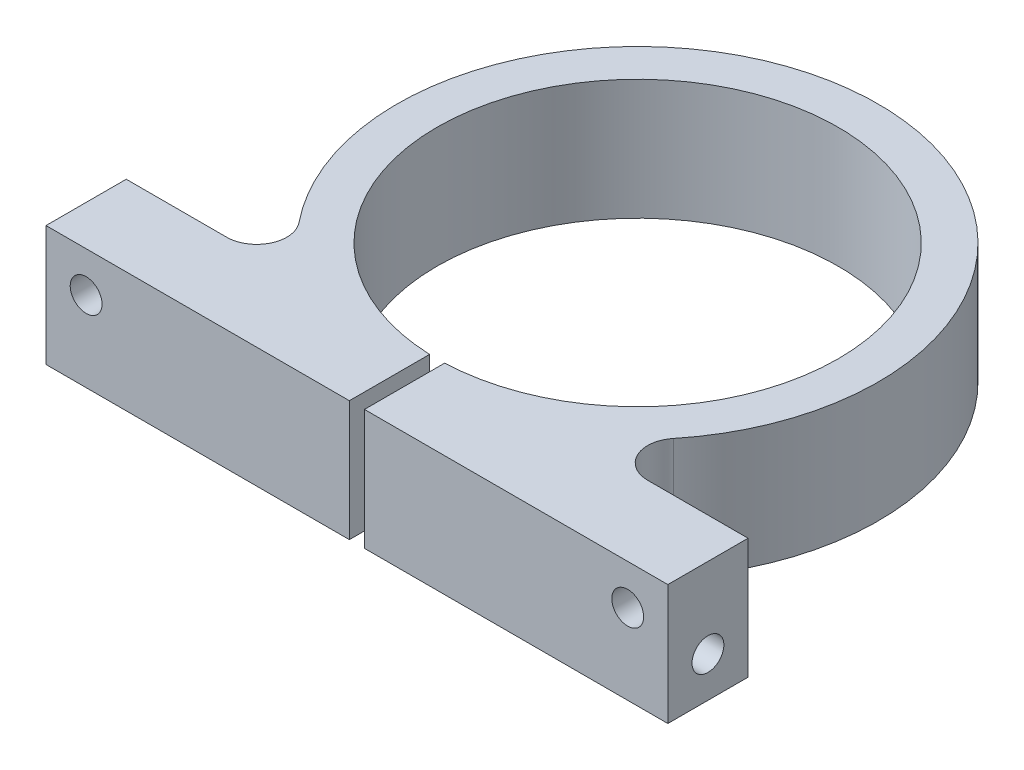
ISO-10303-21;
HEADER;
FILE_DESCRIPTION(('STEP AP214'),'2;1');
FILE_NAME('part.step','',(''),(''),'','','');
FILE_SCHEMA(('AUTOMOTIVE_DESIGN { 1 0 10303 214 1 1 1 1 }'));
ENDSEC;
DATA;
#1=APPLICATION_CONTEXT('core data for automotive mechanical design processes');
#2=APPLICATION_PROTOCOL_DEFINITION('international standard','automotive_design',2000,#1);
#3=PRODUCT_CONTEXT('',#1,'mechanical');
#4=PRODUCT('Part','Part','',(#3));
#5=PRODUCT_RELATED_PRODUCT_CATEGORY('part','',(#4));
#6=PRODUCT_DEFINITION_FORMATION('','',#4);
#7=PRODUCT_DEFINITION_CONTEXT('part definition',#1,'design');
#8=PRODUCT_DEFINITION('design','',#6,#7);
#9=PRODUCT_DEFINITION_SHAPE('','',#8);
#10=(LENGTH_UNIT() NAMED_UNIT(*) SI_UNIT(.MILLI.,.METRE.));
#11=(NAMED_UNIT(*) PLANE_ANGLE_UNIT() SI_UNIT($,.RADIAN.));
#12=(NAMED_UNIT(*) SI_UNIT($,.STERADIAN.) SOLID_ANGLE_UNIT());
#13=UNCERTAINTY_MEASURE_WITH_UNIT(LENGTH_MEASURE(1.E-05),#10,'distance_accuracy_value','');
#14=(GEOMETRIC_REPRESENTATION_CONTEXT(3) GLOBAL_UNCERTAINTY_ASSIGNED_CONTEXT((#13)) GLOBAL_UNIT_ASSIGNED_CONTEXT((#10,
#11,#12)) REPRESENTATION_CONTEXT('',''));
#15=CARTESIAN_POINT('',(0.,0.,0.));
#16=DIRECTION('',(0.,0.,1.));
#17=DIRECTION('',(1.,0.,0.));
#18=AXIS2_PLACEMENT_3D('',#15,#16,#17);
#19=CARTESIAN_POINT('',(-98.425,38.1,63.4550972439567));
#20=DIRECTION('',(1.,0.,0.));
#21=DIRECTION('',(0.,0.,-1.));
#22=AXIS2_PLACEMENT_3D('',#19,#20,#21);
#23=PLANE('',#22);
#24=CARTESIAN_POINT('',(-98.425,12.7,76.1550972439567));
#25=DIRECTION('',(-1.,0.,0.));
#26=DIRECTION('',(0.,0.,1.));
#27=AXIS2_PLACEMENT_3D('',#24,#25,#26);
#28=CIRCLE('',#27,5.04189999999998);
#29=CARTESIAN_POINT('',(-98.425,12.7,81.1969972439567));
#30=VERTEX_POINT('',#29);
#31=EDGE_CURVE('E274',#30,#30,#28,.T.);
#32=ORIENTED_EDGE('',*,*,#31,.F.);
#33=EDGE_LOOP('',(#32));
#34=FACE_BOUND('',#33,.T.);
#35=DIRECTION('',(0.,0.,1.));
#36=VECTOR('',#35,1.);
#37=CARTESIAN_POINT('',(-98.425,0.,63.4550972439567));
#38=LINE('',#37,#36);
#39=CARTESIAN_POINT('',(-98.425,0.,63.4550972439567));
#40=VERTEX_POINT('',#39);
#41=CARTESIAN_POINT('',(-98.425,0.,88.8550972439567));
#42=VERTEX_POINT('',#41);
#43=EDGE_CURVE('E124',#40,#42,#38,.T.);
#44=ORIENTED_EDGE('',*,*,#43,.T.);
#45=DIRECTION('',(0.,-1.,0.));
#46=VECTOR('',#45,1.);
#47=CARTESIAN_POINT('',(-98.425,38.1,88.8550972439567));
#48=LINE('',#47,#46);
#49=CARTESIAN_POINT('',(-98.425,38.1,88.8550972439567));
#50=VERTEX_POINT('',#49);
#51=EDGE_CURVE('E11',#50,#42,#48,.T.);
#52=ORIENTED_EDGE('',*,*,#51,.F.);
#53=DIRECTION('',(0.,0.,1.));
#54=VECTOR('',#53,1.);
#55=CARTESIAN_POINT('',(-98.425,38.1,63.4550972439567));
#56=LINE('',#55,#54);
#57=CARTESIAN_POINT('',(-98.425,38.1,63.4550972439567));
#58=VERTEX_POINT('',#57);
#59=EDGE_CURVE('E164',#58,#50,#56,.T.);
#60=ORIENTED_EDGE('',*,*,#59,.F.);
#61=DIRECTION('',(0.,-1.,0.));
#62=VECTOR('',#61,1.);
#63=CARTESIAN_POINT('',(-98.425,38.1,63.4550972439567));
#64=LINE('',#63,#62);
#65=EDGE_CURVE('E137',#58,#40,#64,.T.);
#66=ORIENTED_EDGE('',*,*,#65,.T.);
#67=EDGE_LOOP('',(#44,#52,#60,#66));
#68=FACE_BOUND('',#67,.T.);
#69=ADVANCED_FACE('F32',(#34,#68),#23,.F.);
#70=CARTESIAN_POINT('',(-98.425,38.1,88.8550972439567));
#71=DIRECTION('',(0.,0.,-1.));
#72=DIRECTION('',(-1.,0.,0.));
#73=AXIS2_PLACEMENT_3D('',#70,#71,#72);
#74=PLANE('',#73);
#75=CARTESIAN_POINT('',(-85.725,25.4,88.8550972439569));
#76=DIRECTION('',(0.,0.,-1.));
#77=DIRECTION('',(-1.,0.,0.));
#78=AXIS2_PLACEMENT_3D('',#75,#76,#77);
#79=CIRCLE('',#78,5.04189999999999);
#80=CARTESIAN_POINT('',(-90.7669,25.4,88.8550972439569));
#81=VERTEX_POINT('',#80);
#82=EDGE_CURVE('E285',#81,#81,#79,.T.);
#83=ORIENTED_EDGE('',*,*,#82,.T.);
#84=EDGE_LOOP('',(#83));
#85=FACE_BOUND('',#84,.T.);
#86=DIRECTION('',(1.,0.,0.));
#87=VECTOR('',#86,1.);
#88=CARTESIAN_POINT('',(-98.425,0.,88.8550972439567));
#89=LINE('',#88,#87);
#90=CARTESIAN_POINT('',(-2.3876,0.,88.8550972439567));
#91=VERTEX_POINT('',#90);
#92=EDGE_CURVE('E120',#42,#91,#89,.T.);
#93=ORIENTED_EDGE('',*,*,#92,.T.);
#94=DIRECTION('',(0.,-1.,0.));
#95=VECTOR('',#94,1.);
#96=CARTESIAN_POINT('',(-2.3876,38.1,88.8550972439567));
#97=LINE('',#96,#95);
#98=CARTESIAN_POINT('',(-2.3876,38.1,88.8550972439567));
#99=VERTEX_POINT('',#98);
#100=EDGE_CURVE('E39',#99,#91,#97,.T.);
#101=ORIENTED_EDGE('',*,*,#100,.F.);
#102=DIRECTION('',(1.,0.,0.));
#103=VECTOR('',#102,1.);
#104=CARTESIAN_POINT('',(-98.425,38.1,88.8550972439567));
#105=LINE('',#104,#103);
#106=EDGE_CURVE('E133',#50,#99,#105,.T.);
#107=ORIENTED_EDGE('',*,*,#106,.F.);
#108=ORIENTED_EDGE('',*,*,#51,.T.);
#109=EDGE_LOOP('',(#93,#101,#107,#108));
#110=FACE_BOUND('',#109,.T.);
#111=ADVANCED_FACE('F132',(#85,#110),#74,.F.);
#112=CARTESIAN_POINT('',(-2.3876,38.1,88.8550972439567));
#113=DIRECTION('',(-1.,0.,0.));
#114=DIRECTION('',(0.,0.,1.));
#115=AXIS2_PLACEMENT_3D('',#112,#113,#114);
#116=PLANE('',#115);
#117=CARTESIAN_POINT('',(-2.3876,12.7,76.1550972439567));
#118=DIRECTION('',(-1.,0.,0.));
#119=DIRECTION('',(0.,0.,1.));
#120=AXIS2_PLACEMENT_3D('',#117,#118,#119);
#121=CIRCLE('',#120,5.04189999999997);
#122=CARTESIAN_POINT('',(-2.3876,12.7,81.1969972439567));
#123=VERTEX_POINT('',#122);
#124=EDGE_CURVE('E138',#123,#123,#121,.T.);
#125=ORIENTED_EDGE('',*,*,#124,.T.);
#126=EDGE_LOOP('',(#125));
#127=FACE_BOUND('',#126,.T.);
#128=DIRECTION('',(0.,0.,-1.));
#129=VECTOR('',#128,1.);
#130=CARTESIAN_POINT('',(-2.3876,0.,88.8550972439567));
#131=LINE('',#130,#129);
#132=CARTESIAN_POINT('',(-2.38760000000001,0.,63.4550972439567));
#133=VERTEX_POINT('',#132);
#134=EDGE_CURVE('E126',#91,#133,#131,.T.);
#135=ORIENTED_EDGE('',*,*,#134,.T.);
#136=DIRECTION('',(0.,-1.,0.));
#137=VECTOR('',#136,1.);
#138=CARTESIAN_POINT('',(-2.38760000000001,38.1,63.4550972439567));
#139=LINE('',#138,#137);
#140=CARTESIAN_POINT('',(-2.38760000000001,38.1,63.4550972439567));
#141=VERTEX_POINT('',#140);
#142=EDGE_CURVE('E210',#141,#133,#139,.T.);
#143=ORIENTED_EDGE('',*,*,#142,.F.);
#144=DIRECTION('',(0.,0.,-1.));
#145=VECTOR('',#144,1.);
#146=CARTESIAN_POINT('',(-2.3876,38.1,88.8550972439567));
#147=LINE('',#146,#145);
#148=EDGE_CURVE('E167',#99,#141,#147,.T.);
#149=ORIENTED_EDGE('',*,*,#148,.F.);
#150=ORIENTED_EDGE('',*,*,#100,.T.);
#151=EDGE_LOOP('',(#135,#143,#149,#150));
#152=FACE_BOUND('',#151,.T.);
#153=ADVANCED_FACE('F214',(#127,#152),#116,.F.);
#154=CARTESIAN_POINT('',(0.,38.1,0.));
#155=DIRECTION('',(0.,-1.,0.));
#156=DIRECTION('',(0.,0.,-1.));
#157=AXIS2_PLACEMENT_3D('',#154,#155,#156);
#158=CYLINDRICAL_SURFACE('',#157,63.5);
#159=CARTESIAN_POINT('',(0.,0.,0.));
#160=DIRECTION('',(0.,-1.,0.));
#161=DIRECTION('',(0.,0.,1.));
#162=AXIS2_PLACEMENT_3D('',#159,#160,#161);
#163=CIRCLE('',#162,63.5);
#164=CARTESIAN_POINT('',(2.3876,0.,63.4550972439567));
#165=VERTEX_POINT('',#164);
#166=EDGE_CURVE('E146',#133,#165,#163,.T.);
#167=ORIENTED_EDGE('',*,*,#166,.T.);
#168=DIRECTION('',(0.,-1.,0.));
#169=VECTOR('',#168,1.);
#170=CARTESIAN_POINT('',(2.3876,38.1,63.4550972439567));
#171=LINE('',#170,#169);
#172=CARTESIAN_POINT('',(2.3876,38.1,63.4550972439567));
#173=VERTEX_POINT('',#172);
#174=EDGE_CURVE('E207',#173,#165,#171,.T.);
#175=ORIENTED_EDGE('',*,*,#174,.F.);
#176=CARTESIAN_POINT('',(0.,38.1,0.));
#177=DIRECTION('',(0.,-1.,0.));
#178=DIRECTION('',(0.,0.,1.));
#179=AXIS2_PLACEMENT_3D('',#176,#177,#178);
#180=CIRCLE('',#179,63.5);
#181=EDGE_CURVE('E169',#141,#173,#180,.T.);
#182=ORIENTED_EDGE('',*,*,#181,.F.);
#183=ORIENTED_EDGE('',*,*,#142,.T.);
#184=EDGE_LOOP('',(#167,#175,#182,#183));
#185=FACE_BOUND('',#184,.T.);
#186=ADVANCED_FACE('F222',(#185),#158,.F.);
#187=CARTESIAN_POINT('',(2.3876,38.1,88.8550972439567));
#188=DIRECTION('',(1.,0.,0.));
#189=DIRECTION('',(0.,0.,-1.));
#190=AXIS2_PLACEMENT_3D('',#187,#188,#189);
#191=PLANE('',#190);
#192=CARTESIAN_POINT('',(2.3876,12.7,76.1550972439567));
#193=DIRECTION('',(1.,0.,0.));
#194=DIRECTION('',(0.,0.,-1.));
#195=AXIS2_PLACEMENT_3D('',#192,#193,#194);
#196=CIRCLE('',#195,5.04189999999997);
#197=CARTESIAN_POINT('',(2.3876,12.7,71.1131972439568));
#198=VERTEX_POINT('',#197);
#199=EDGE_CURVE('E141',#198,#198,#196,.T.);
#200=ORIENTED_EDGE('',*,*,#199,.T.);
#201=EDGE_LOOP('',(#200));
#202=FACE_BOUND('',#201,.T.);
#203=DIRECTION('',(0.,0.,1.));
#204=VECTOR('',#203,1.);
#205=CARTESIAN_POINT('',(2.3876,0.,88.8550972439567));
#206=LINE('',#205,#204);
#207=CARTESIAN_POINT('',(2.3876,0.,88.8550972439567));
#208=VERTEX_POINT('',#207);
#209=EDGE_CURVE('E148',#165,#208,#206,.T.);
#210=ORIENTED_EDGE('',*,*,#209,.T.);
#211=DIRECTION('',(0.,-1.,0.));
#212=VECTOR('',#211,1.);
#213=CARTESIAN_POINT('',(2.3876,38.1,88.8550972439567));
#214=LINE('',#213,#212);
#215=CARTESIAN_POINT('',(2.3876,38.1,88.8550972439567));
#216=VERTEX_POINT('',#215);
#217=EDGE_CURVE('E204',#216,#208,#214,.T.);
#218=ORIENTED_EDGE('',*,*,#217,.F.);
#219=DIRECTION('',(0.,0.,1.));
#220=VECTOR('',#219,1.);
#221=CARTESIAN_POINT('',(2.3876,38.1,88.8550972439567));
#222=LINE('',#221,#220);
#223=EDGE_CURVE('E171',#173,#216,#222,.T.);
#224=ORIENTED_EDGE('',*,*,#223,.F.);
#225=ORIENTED_EDGE('',*,*,#174,.T.);
#226=EDGE_LOOP('',(#210,#218,#224,#225));
#227=FACE_BOUND('',#226,.T.);
#228=ADVANCED_FACE('F225',(#202,#227),#191,.F.);
#229=CARTESIAN_POINT('',(2.3876,38.1,88.8550972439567));
#230=DIRECTION('',(0.,0.,-1.));
#231=DIRECTION('',(-1.,0.,0.));
#232=AXIS2_PLACEMENT_3D('',#229,#230,#231);
#233=PLANE('',#232);
#234=CARTESIAN_POINT('',(85.725,25.4,88.8550972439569));
#235=DIRECTION('',(0.,0.,-1.));
#236=DIRECTION('',(-1.,0.,0.));
#237=AXIS2_PLACEMENT_3D('',#234,#235,#236);
#238=CIRCLE('',#237,5.04189999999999);
#239=CARTESIAN_POINT('',(80.6831,25.4,88.8550972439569));
#240=VERTEX_POINT('',#239);
#241=EDGE_CURVE('E291',#240,#240,#238,.T.);
#242=ORIENTED_EDGE('',*,*,#241,.T.);
#243=EDGE_LOOP('',(#242));
#244=FACE_BOUND('',#243,.T.);
#245=DIRECTION('',(1.,0.,0.));
#246=VECTOR('',#245,1.);
#247=CARTESIAN_POINT('',(2.3876,0.,88.8550972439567));
#248=LINE('',#247,#246);
#249=CARTESIAN_POINT('',(98.425,0.,88.8550972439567));
#250=VERTEX_POINT('',#249);
#251=EDGE_CURVE('E150',#208,#250,#248,.T.);
#252=ORIENTED_EDGE('',*,*,#251,.T.);
#253=DIRECTION('',(0.,-1.,0.));
#254=VECTOR('',#253,1.);
#255=CARTESIAN_POINT('',(98.425,38.1,88.8550972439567));
#256=LINE('',#255,#254);
#257=CARTESIAN_POINT('',(98.425,38.1,88.8550972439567));
#258=VERTEX_POINT('',#257);
#259=EDGE_CURVE('E201',#258,#250,#256,.T.);
#260=ORIENTED_EDGE('',*,*,#259,.F.);
#261=DIRECTION('',(1.,0.,0.));
#262=VECTOR('',#261,1.);
#263=CARTESIAN_POINT('',(2.3876,38.1,88.8550972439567));
#264=LINE('',#263,#262);
#265=EDGE_CURVE('E173',#216,#258,#264,.T.);
#266=ORIENTED_EDGE('',*,*,#265,.F.);
#267=ORIENTED_EDGE('',*,*,#217,.T.);
#268=EDGE_LOOP('',(#252,#260,#266,#267));
#269=FACE_BOUND('',#268,.T.);
#270=ADVANCED_FACE('F230',(#244,#269),#233,.F.);
#271=CARTESIAN_POINT('',(98.425,38.1,63.4550972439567));
#272=DIRECTION('',(-1.,0.,0.));
#273=DIRECTION('',(0.,0.,1.));
#274=AXIS2_PLACEMENT_3D('',#271,#272,#273);
#275=PLANE('',#274);
#276=CARTESIAN_POINT('',(98.425,12.7,76.1550972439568));
#277=DIRECTION('',(-1.,0.,0.));
#278=DIRECTION('',(0.,0.,1.));
#279=AXIS2_PLACEMENT_3D('',#276,#277,#278);
#280=CIRCLE('',#279,5.04189999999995);
#281=CARTESIAN_POINT('',(98.425,12.7,81.1969972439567));
#282=VERTEX_POINT('',#281);
#283=EDGE_CURVE('E276',#282,#282,#280,.T.);
#284=ORIENTED_EDGE('',*,*,#283,.T.);
#285=EDGE_LOOP('',(#284));
#286=FACE_BOUND('',#285,.T.);
#287=DIRECTION('',(0.,0.,-1.));
#288=VECTOR('',#287,1.);
#289=CARTESIAN_POINT('',(98.425,0.,63.4550972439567));
#290=LINE('',#289,#288);
#291=CARTESIAN_POINT('',(98.425,0.,63.4550972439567));
#292=VERTEX_POINT('',#291);
#293=EDGE_CURVE('E152',#250,#292,#290,.T.);
#294=ORIENTED_EDGE('',*,*,#293,.T.);
#295=DIRECTION('',(0.,-1.,0.));
#296=VECTOR('',#295,1.);
#297=CARTESIAN_POINT('',(98.425,38.1,63.4550972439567));
#298=LINE('',#297,#296);
#299=CARTESIAN_POINT('',(98.425,38.1,63.4550972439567));
#300=VERTEX_POINT('',#299);
#301=EDGE_CURVE('E198',#300,#292,#298,.T.);
#302=ORIENTED_EDGE('',*,*,#301,.F.);
#303=DIRECTION('',(0.,0.,-1.));
#304=VECTOR('',#303,1.);
#305=CARTESIAN_POINT('',(98.425,38.1,63.4550972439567));
#306=LINE('',#305,#304);
#307=EDGE_CURVE('E175',#258,#300,#306,.T.);
#308=ORIENTED_EDGE('',*,*,#307,.F.);
#309=ORIENTED_EDGE('',*,*,#259,.T.);
#310=EDGE_LOOP('',(#294,#302,#308,#309));
#311=FACE_BOUND('',#310,.T.);
#312=ADVANCED_FACE('F236',(#286,#311),#275,.F.);
#313=CARTESIAN_POINT('',(66.6357279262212,38.1,63.4550972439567));
#314=DIRECTION('',(0.,0.,1.));
#315=DIRECTION('',(1.,0.,0.));
#316=AXIS2_PLACEMENT_3D('',#313,#314,#315);
#317=PLANE('',#316);
#318=CARTESIAN_POINT('',(85.725,25.4,63.4550972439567));
#319=DIRECTION('',(0.,0.,-1.));
#320=DIRECTION('',(-1.,0.,0.));
#321=AXIS2_PLACEMENT_3D('',#318,#319,#320);
#322=CIRCLE('',#321,5.0419);
#323=CARTESIAN_POINT('',(80.6831,25.4,63.4550972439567));
#324=VERTEX_POINT('',#323);
#325=EDGE_CURVE('E288',#324,#324,#322,.T.);
#326=ORIENTED_EDGE('',*,*,#325,.F.);
#327=EDGE_LOOP('',(#326));
#328=FACE_BOUND('',#327,.T.);
#329=DIRECTION('',(-1.,0.,0.));
#330=VECTOR('',#329,1.);
#331=CARTESIAN_POINT('',(66.6357279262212,0.,63.4550972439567));
#332=LINE('',#331,#330);
#333=CARTESIAN_POINT('',(66.6357279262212,0.,63.4550972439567));
#334=VERTEX_POINT('',#333);
#335=EDGE_CURVE('E154',#292,#334,#332,.T.);
#336=ORIENTED_EDGE('',*,*,#335,.T.);
#337=DIRECTION('',(0.,-1.,0.));
#338=VECTOR('',#337,1.);
#339=CARTESIAN_POINT('',(66.6357279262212,38.1,63.4550972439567));
#340=LINE('',#339,#338);
#341=CARTESIAN_POINT('',(66.6357279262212,38.1,63.4550972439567));
#342=VERTEX_POINT('',#341);
#343=EDGE_CURVE('E195',#342,#334,#340,.T.);
#344=ORIENTED_EDGE('',*,*,#343,.F.);
#345=DIRECTION('',(-1.,0.,0.));
#346=VECTOR('',#345,1.);
#347=CARTESIAN_POINT('',(66.6357279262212,38.1,63.4550972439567));
#348=LINE('',#347,#346);
#349=EDGE_CURVE('E177',#300,#342,#348,.T.);
#350=ORIENTED_EDGE('',*,*,#349,.F.);
#351=ORIENTED_EDGE('',*,*,#301,.T.);
#352=EDGE_LOOP('',(#336,#344,#350,#351));
#353=FACE_BOUND('',#352,.T.);
#354=ADVANCED_FACE('F240',(#328,#353),#317,.F.);
#355=CARTESIAN_POINT('',(66.6357279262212,38.1,53.9300972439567));
#356=DIRECTION('',(0.,-1.,0.));
#357=DIRECTION('',(0.,0.,-1.));
#358=AXIS2_PLACEMENT_3D('',#355,#356,#357);
#359=CYLINDRICAL_SURFACE('',#358,9.52500000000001);
#360=CARTESIAN_POINT('',(66.6357279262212,0.,53.9300972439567));
#361=DIRECTION('',(0.,-1.,0.));
#362=DIRECTION('',(0.,0.,-1.));
#363=AXIS2_PLACEMENT_3D('',#360,#361,#362);
#364=CIRCLE('',#363,9.52500000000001);
#365=CARTESIAN_POINT('',(59.231758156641,0.,47.9378642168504));
#366=VERTEX_POINT('',#365);
#367=EDGE_CURVE('E156',#334,#366,#364,.T.);
#368=ORIENTED_EDGE('',*,*,#367,.T.);
#369=DIRECTION('',(0.,-1.,0.));
#370=VECTOR('',#369,1.);
#371=CARTESIAN_POINT('',(59.231758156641,38.1,47.9378642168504));
#372=LINE('',#371,#370);
#373=CARTESIAN_POINT('',(59.231758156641,38.1,47.9378642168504));
#374=VERTEX_POINT('',#373);
#375=EDGE_CURVE('E192',#374,#366,#372,.T.);
#376=ORIENTED_EDGE('',*,*,#375,.F.);
#377=CARTESIAN_POINT('',(66.6357279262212,38.1,53.9300972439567));
#378=DIRECTION('',(0.,-1.,0.));
#379=DIRECTION('',(0.,0.,-1.));
#380=AXIS2_PLACEMENT_3D('',#377,#378,#379);
#381=CIRCLE('',#380,9.52500000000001);
#382=EDGE_CURVE('E179',#342,#374,#381,.T.);
#383=ORIENTED_EDGE('',*,*,#382,.F.);
#384=ORIENTED_EDGE('',*,*,#343,.T.);
#385=EDGE_LOOP('',(#368,#376,#383,#384));
#386=FACE_BOUND('',#385,.T.);
#387=ADVANCED_FACE('F245',(#386),#359,.F.);
#388=CARTESIAN_POINT('',(0.,38.1,0.));
#389=DIRECTION('',(0.,-1.,0.));
#390=DIRECTION('',(0.,0.,-1.));
#391=AXIS2_PLACEMENT_3D('',#388,#389,#390);
#392=CYLINDRICAL_SURFACE('',#391,76.2);
#393=CARTESIAN_POINT('',(0.,0.,0.));
#394=DIRECTION('',(0.,1.,0.));
#395=DIRECTION('',(0.,0.,1.));
#396=AXIS2_PLACEMENT_3D('',#393,#394,#395);
#397=CIRCLE('',#396,76.2);
#398=CARTESIAN_POINT('',(-59.2317581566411,0.,47.9378642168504));
#399=VERTEX_POINT('',#398);
#400=EDGE_CURVE('E158',#366,#399,#397,.T.);
#401=ORIENTED_EDGE('',*,*,#400,.T.);
#402=DIRECTION('',(0.,-1.,0.));
#403=VECTOR('',#402,1.);
#404=CARTESIAN_POINT('',(-59.2317581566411,38.1,47.9378642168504));
#405=LINE('',#404,#403);
#406=CARTESIAN_POINT('',(-59.2317581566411,38.1,47.9378642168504));
#407=VERTEX_POINT('',#406);
#408=EDGE_CURVE('E189',#407,#399,#405,.T.);
#409=ORIENTED_EDGE('',*,*,#408,.F.);
#410=CARTESIAN_POINT('',(0.,38.1,0.));
#411=DIRECTION('',(0.,1.,0.));
#412=DIRECTION('',(0.,0.,1.));
#413=AXIS2_PLACEMENT_3D('',#410,#411,#412);
#414=CIRCLE('',#413,76.2);
#415=EDGE_CURVE('E181',#374,#407,#414,.T.);
#416=ORIENTED_EDGE('',*,*,#415,.F.);
#417=ORIENTED_EDGE('',*,*,#375,.T.);
#418=EDGE_LOOP('',(#401,#409,#416,#417));
#419=FACE_BOUND('',#418,.T.);
#420=ADVANCED_FACE('F249',(#419),#392,.T.);
#421=CARTESIAN_POINT('',(-66.6357279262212,38.1,53.9300972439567));
#422=DIRECTION('',(0.,-1.,0.));
#423=DIRECTION('',(0.,0.,-1.));
#424=AXIS2_PLACEMENT_3D('',#421,#422,#423);
#425=CYLINDRICAL_SURFACE('',#424,9.52500000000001);
#426=CARTESIAN_POINT('',(-66.6357279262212,0.,53.9300972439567));
#427=DIRECTION('',(0.,-1.,0.));
#428=DIRECTION('',(0.,0.,1.));
#429=AXIS2_PLACEMENT_3D('',#426,#427,#428);
#430=CIRCLE('',#429,9.52500000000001);
#431=CARTESIAN_POINT('',(-66.6357279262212,0.,63.4550972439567));
#432=VERTEX_POINT('',#431);
#433=EDGE_CURVE('E160',#399,#432,#430,.T.);
#434=ORIENTED_EDGE('',*,*,#433,.T.);
#435=DIRECTION('',(0.,-1.,0.));
#436=VECTOR('',#435,1.);
#437=CARTESIAN_POINT('',(-66.6357279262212,38.1,63.4550972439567));
#438=LINE('',#437,#436);
#439=CARTESIAN_POINT('',(-66.6357279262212,38.1,63.4550972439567));
#440=VERTEX_POINT('',#439);
#441=EDGE_CURVE('E186',#440,#432,#438,.T.);
#442=ORIENTED_EDGE('',*,*,#441,.F.);
#443=CARTESIAN_POINT('',(-66.6357279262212,38.1,53.9300972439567));
#444=DIRECTION('',(0.,-1.,0.));
#445=DIRECTION('',(0.,0.,1.));
#446=AXIS2_PLACEMENT_3D('',#443,#444,#445);
#447=CIRCLE('',#446,9.52500000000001);
#448=EDGE_CURVE('E51',#407,#440,#447,.T.);
#449=ORIENTED_EDGE('',*,*,#448,.F.);
#450=ORIENTED_EDGE('',*,*,#408,.T.);
#451=EDGE_LOOP('',(#434,#442,#449,#450));
#452=FACE_BOUND('',#451,.T.);
#453=ADVANCED_FACE('F253',(#452),#425,.F.);
#454=CARTESIAN_POINT('',(-98.425,38.1,63.4550972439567));
#455=DIRECTION('',(0.,0.,1.));
#456=DIRECTION('',(1.,0.,0.));
#457=AXIS2_PLACEMENT_3D('',#454,#455,#456);
#458=PLANE('',#457);
#459=CARTESIAN_POINT('',(-85.725,25.4,63.4550972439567));
#460=DIRECTION('',(0.,0.,-1.));
#461=DIRECTION('',(-1.,0.,0.));
#462=AXIS2_PLACEMENT_3D('',#459,#460,#461);
#463=CIRCLE('',#462,5.0419);
#464=CARTESIAN_POINT('',(-90.7669,25.4,63.4550972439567));
#465=VERTEX_POINT('',#464);
#466=EDGE_CURVE('E280',#465,#465,#463,.T.);
#467=ORIENTED_EDGE('',*,*,#466,.F.);
#468=EDGE_LOOP('',(#467));
#469=FACE_BOUND('',#468,.T.);
#470=DIRECTION('',(-1.,0.,0.));
#471=VECTOR('',#470,1.);
#472=CARTESIAN_POINT('',(-98.425,0.,63.4550972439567));
#473=LINE('',#472,#471);
#474=EDGE_CURVE('E162',#432,#40,#473,.T.);
#475=ORIENTED_EDGE('',*,*,#474,.T.);
#476=ORIENTED_EDGE('',*,*,#65,.F.);
#477=DIRECTION('',(-1.,0.,0.));
#478=VECTOR('',#477,1.);
#479=CARTESIAN_POINT('',(-98.425,38.1,63.4550972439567));
#480=LINE('',#479,#478);
#481=EDGE_CURVE('E46',#440,#58,#480,.T.);
#482=ORIENTED_EDGE('',*,*,#481,.F.);
#483=ORIENTED_EDGE('',*,*,#441,.T.);
#484=EDGE_LOOP('',(#475,#476,#482,#483));
#485=FACE_BOUND('',#484,.T.);
#486=ADVANCED_FACE('F255',(#469,#485),#458,.F.);
#487=CARTESIAN_POINT('',(0.,38.1,0.));
#488=DIRECTION('',(0.,1.,0.));
#489=DIRECTION('',(0.,0.,1.));
#490=AXIS2_PLACEMENT_3D('',#487,#488,#489);
#491=PLANE('',#490);
#492=ORIENTED_EDGE('',*,*,#59,.T.);
#493=ORIENTED_EDGE('',*,*,#106,.T.);
#494=ORIENTED_EDGE('',*,*,#148,.T.);
#495=ORIENTED_EDGE('',*,*,#181,.T.);
#496=ORIENTED_EDGE('',*,*,#223,.T.);
#497=ORIENTED_EDGE('',*,*,#265,.T.);
#498=ORIENTED_EDGE('',*,*,#307,.T.);
#499=ORIENTED_EDGE('',*,*,#349,.T.);
#500=ORIENTED_EDGE('',*,*,#382,.T.);
#501=ORIENTED_EDGE('',*,*,#415,.T.);
#502=ORIENTED_EDGE('',*,*,#448,.T.);
#503=ORIENTED_EDGE('',*,*,#481,.T.);
#504=EDGE_LOOP('',(#492,#493,#494,#495,#496,#497,#498,#499,#500,#501,#502,#503));
#505=FACE_BOUND('',#504,.T.);
#506=ADVANCED_FACE('F217',(#505),#491,.T.);
#507=CARTESIAN_POINT('',(0.,0.,0.));
#508=DIRECTION('',(0.,1.,0.));
#509=DIRECTION('',(0.,0.,1.));
#510=AXIS2_PLACEMENT_3D('',#507,#508,#509);
#511=PLANE('',#510);
#512=ORIENTED_EDGE('',*,*,#43,.F.);
#513=ORIENTED_EDGE('',*,*,#474,.F.);
#514=ORIENTED_EDGE('',*,*,#433,.F.);
#515=ORIENTED_EDGE('',*,*,#400,.F.);
#516=ORIENTED_EDGE('',*,*,#367,.F.);
#517=ORIENTED_EDGE('',*,*,#335,.F.);
#518=ORIENTED_EDGE('',*,*,#293,.F.);
#519=ORIENTED_EDGE('',*,*,#251,.F.);
#520=ORIENTED_EDGE('',*,*,#209,.F.);
#521=ORIENTED_EDGE('',*,*,#166,.F.);
#522=ORIENTED_EDGE('',*,*,#134,.F.);
#523=ORIENTED_EDGE('',*,*,#92,.F.);
#524=EDGE_LOOP('',(#512,#513,#514,#515,#516,#517,#518,#519,#520,#521,#522,#523));
#525=FACE_BOUND('',#524,.T.);
#526=ADVANCED_FACE('F121',(#525),#511,.F.);
#527=CARTESIAN_POINT('',(-98.425,12.7,76.1550972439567));
#528=DIRECTION('',(-1.,0.,0.));
#529=DIRECTION('',(0.,0.,1.));
#530=AXIS2_PLACEMENT_3D('',#527,#528,#529);
#531=CYLINDRICAL_SURFACE('',#530,5.04189999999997);
#532=ORIENTED_EDGE('',*,*,#283,.F.);
#533=EDGE_LOOP('',(#532));
#534=FACE_BOUND('',#533,.T.);
#535=ORIENTED_EDGE('',*,*,#199,.F.);
#536=EDGE_LOOP('',(#535));
#537=FACE_BOUND('',#536,.T.);
#538=ADVANCED_FACE('F329',(#534,#537),#531,.F.);
#539=ORIENTED_EDGE('',*,*,#31,.T.);
#540=EDGE_LOOP('',(#539));
#541=FACE_BOUND('',#540,.T.);
#542=ORIENTED_EDGE('',*,*,#124,.F.);
#543=EDGE_LOOP('',(#542));
#544=FACE_BOUND('',#543,.T.);
#545=ADVANCED_FACE('F327',(#541,#544),#531,.F.);
#546=CARTESIAN_POINT('',(-85.725,25.4,63.4550972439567));
#547=DIRECTION('',(0.,0.,-1.));
#548=DIRECTION('',(-1.,0.,0.));
#549=AXIS2_PLACEMENT_3D('',#546,#547,#548);
#550=CYLINDRICAL_SURFACE('',#549,5.04189999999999);
#551=ORIENTED_EDGE('',*,*,#82,.F.);
#552=EDGE_LOOP('',(#551));
#553=FACE_BOUND('',#552,.T.);
#554=ORIENTED_EDGE('',*,*,#466,.T.);
#555=EDGE_LOOP('',(#554));
#556=FACE_BOUND('',#555,.T.);
#557=ADVANCED_FACE('F299',(#553,#556),#550,.F.);
#558=CARTESIAN_POINT('',(85.725,25.4,63.4550972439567));
#559=DIRECTION('',(0.,0.,-1.));
#560=DIRECTION('',(-1.,0.,0.));
#561=AXIS2_PLACEMENT_3D('',#558,#559,#560);
#562=CYLINDRICAL_SURFACE('',#561,5.04189999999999);
#563=ORIENTED_EDGE('',*,*,#241,.F.);
#564=EDGE_LOOP('',(#563));
#565=FACE_BOUND('',#564,.T.);
#566=ORIENTED_EDGE('',*,*,#325,.T.);
#567=EDGE_LOOP('',(#566));
#568=FACE_BOUND('',#567,.T.);
#569=ADVANCED_FACE('F296',(#565,#568),#562,.F.);
#570=CLOSED_SHELL('',(#69,#111,#153,#186,#228,#270,#312,#354,#387,#420,#453,#486,#506,#526,#538,
#545,#557,#569));
#571=MANIFOLD_SOLID_BREP('B2',#570);
#572=ADVANCED_BREP_SHAPE_REPRESENTATION('',(#18,#571),#14);
#573=SHAPE_DEFINITION_REPRESENTATION(#9,#572);
ENDSEC;
END-ISO-10303-21;
